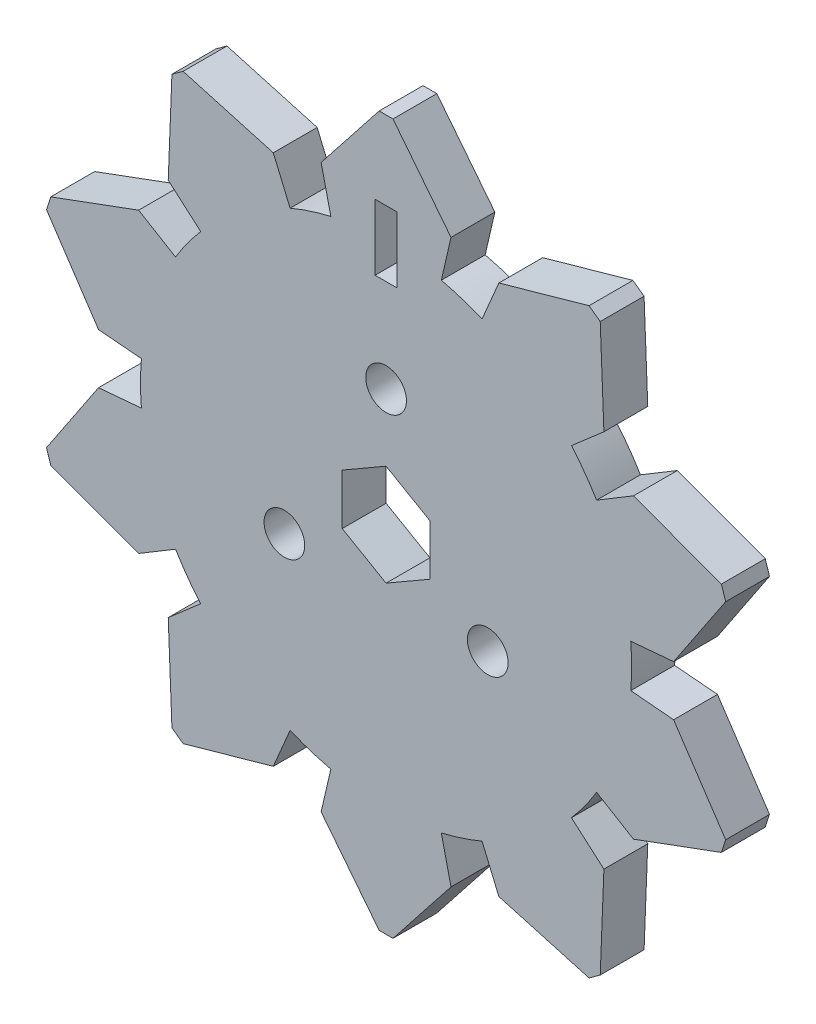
from build123d import *

# Parameters (mm, degrees)
BOSS_EXTRUDE1_DEPTH   = 3.175
F_4_CLEARANCE_HOLE1_D = 2.9464
SKETCH4_W             = 1.5875
SKETCH4_H             = 4.7625
CUT_EXTRUDE1_DEPTH    = 36.696223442


with BuildPart() as part:
    # Sketch1 → Boss-Extrude1 (new body)
    with BuildSketch(Plane.XY):
        with BuildLine():
            Line((-3.999629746, 17.324299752), (-4.70036767, 20.359529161))
            Line((-4.70036767, 20.359529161), (-0.5, 25.686287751))
            Line((-0.5, 25.686287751), (0.5, 25.686287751))
            Line((0.5, 25.686287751), (4.70036767, 20.359529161))
            Line((4.70036767, 20.359529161), (3.999629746, 17.324299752))
            ThreePointArc((3.999629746, 17.324299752), (5.49432216, 16.90978486), (6.947199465, 16.366576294))
            Line((6.947199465, 16.366576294), (8.16435366, 19.234011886))
            Line((8.16435366, 19.234011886), (14.693512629, 21.074535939))
            Line((14.693512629, 21.074535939), (15.502529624, 20.486750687))
            Line((15.502529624, 20.486750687), (15.769708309, 13.708398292))
            Line((15.769708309, 13.708398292), (13.418736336, 11.664729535))
            ThreePointArc((13.418736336, 11.664729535), (14.38432216, 10.450821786), (15.240434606, 9.157376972))
            Line((15.240434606, 9.157376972), (17.910569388, 10.76175581))
            Line((17.910569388, 10.76175581), (24.274602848, 8.413027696))
            Line((24.274602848, 8.413027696), (24.583619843, 7.461971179))
            Line((24.583619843, 7.461971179), (20.815556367, 1.821125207))
            Line((20.815556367, 1.821125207), (17.712341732, 1.549629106))
            ThreePointArc((17.712341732, 1.549629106), (17.78, 0), (17.712341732, -1.549629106))
            Line((17.712341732, -1.549629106), (20.815556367, -1.821125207))
            Line((20.815556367, -1.821125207), (24.583619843, -7.461971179))
            Line((24.583619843, -7.461971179), (24.274602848, -8.413027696))
            Line((24.274602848, -8.413027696), (17.910569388, -10.76175581))
            Line((17.910569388, -10.76175581), (15.240434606, -9.157376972))
            ThreePointArc((15.240434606, -9.157376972), (14.38432216, -10.450821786), (13.418736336, -11.664729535))
            Line((13.418736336, -11.664729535), (15.769708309, -13.708398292))
            Line((15.769708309, -13.708398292), (15.502529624, -20.486750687))
            Line((15.502529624, -20.486750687), (14.693512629, -21.074535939))
            Line((14.693512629, -21.074535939), (8.16435366, -19.234011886))
            Line((8.16435366, -19.234011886), (6.947199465, -16.366576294))
            ThreePointArc((6.947199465, -16.366576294), (5.49432216, -16.90978486), (3.999629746, -17.324299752))
            Line((3.999629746, -17.324299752), (4.70036767, -20.359529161))
            Line((4.70036767, -20.359529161), (0.5, -25.686287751))
            Line((0.5, -25.686287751), (-0.5, -25.686287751))
            Line((-0.5, -25.686287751), (-4.70036767, -20.359529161))
            Line((-4.70036767, -20.359529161), (-3.999629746, -17.324299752))
            ThreePointArc((-3.999629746, -17.324299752), (-5.49432216, -16.90978486), (-6.947199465, -16.366576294))
            Line((-6.947199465, -16.366576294), (-8.16435366, -19.234011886))
            Line((-8.16435366, -19.234011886), (-14.693512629, -21.074535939))
            Line((-14.693512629, -21.074535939), (-15.502529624, -20.486750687))
            Line((-15.502529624, -20.486750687), (-15.769708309, -13.708398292))
            Line((-15.769708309, -13.708398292), (-13.418736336, -11.664729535))
            ThreePointArc((-13.418736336, -11.664729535), (-14.38432216, -10.450821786), (-15.240434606, -9.157376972))
            Line((-15.240434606, -9.157376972), (-17.910569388, -10.76175581))
            Line((-17.910569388, -10.76175581), (-24.274602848, -8.413027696))
            Line((-24.274602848, -8.413027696), (-24.583619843, -7.461971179))
            Line((-24.583619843, -7.461971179), (-20.815556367, -1.821125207))
            Line((-20.815556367, -1.821125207), (-17.712341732, -1.549629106))
            ThreePointArc((-17.712341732, -1.549629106), (-17.78, 0), (-17.712341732, 1.549629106))
            Line((-17.712341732, 1.549629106), (-20.815556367, 1.821125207))
            Line((-20.815556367, 1.821125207), (-24.583619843, 7.461971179))
            Line((-24.583619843, 7.461971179), (-24.274602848, 8.413027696))
            Line((-24.274602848, 8.413027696), (-17.910569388, 10.76175581))
            Line((-17.910569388, 10.76175581), (-15.240434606, 9.157376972))
            ThreePointArc((-15.240434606, 9.157376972), (-14.38432216, 10.450821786), (-13.418736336, 11.664729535))
            Line((-13.418736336, 11.664729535), (-15.769708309, 13.708398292))
            Line((-15.769708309, 13.708398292), (-15.502529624, 20.486750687))
            Line((-15.502529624, 20.486750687), (-14.693512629, 21.074535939))
            Line((-14.693512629, 21.074535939), (-8.16435366, 19.234011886))
            Line((-8.16435366, 19.234011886), (-6.947199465, 16.366576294))
            ThreePointArc((-6.947199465, 16.366576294), (-5.49432216, 16.90978486), (-3.999629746, 17.324299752))
        make_face()
        Polygon((3.175, 1.833087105), (0, 3.666174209), (-3.175, 1.833087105), (-3.175, -1.833087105), (0, -3.666174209), (3.175, -1.833087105), align=None, mode=Mode.SUBTRACT)
    extrude(amount=BOSS_EXTRUDE1_DEPTH)

    # 4 Clearance Hole1 (through all)
    with Locations(Plane.XY.offset(3.175)):
        with Locations((0, 8.5), (7.361215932, -4.25), (-7.361215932, -4.25)):
            Hole(F_4_CLEARANCE_HOLE1_D / 2)

    # Sketch4 → Cut-Extrude1 (cut, through all)
    with BuildSketch(Plane.XY.offset(3.175)):
        with Locations((0, 17.62125)):
            Rectangle(SKETCH4_W, SKETCH4_H)
    extrude(amount=-CUT_EXTRUDE1_DEPTH, mode=Mode.SUBTRACT)


solid = part.part
